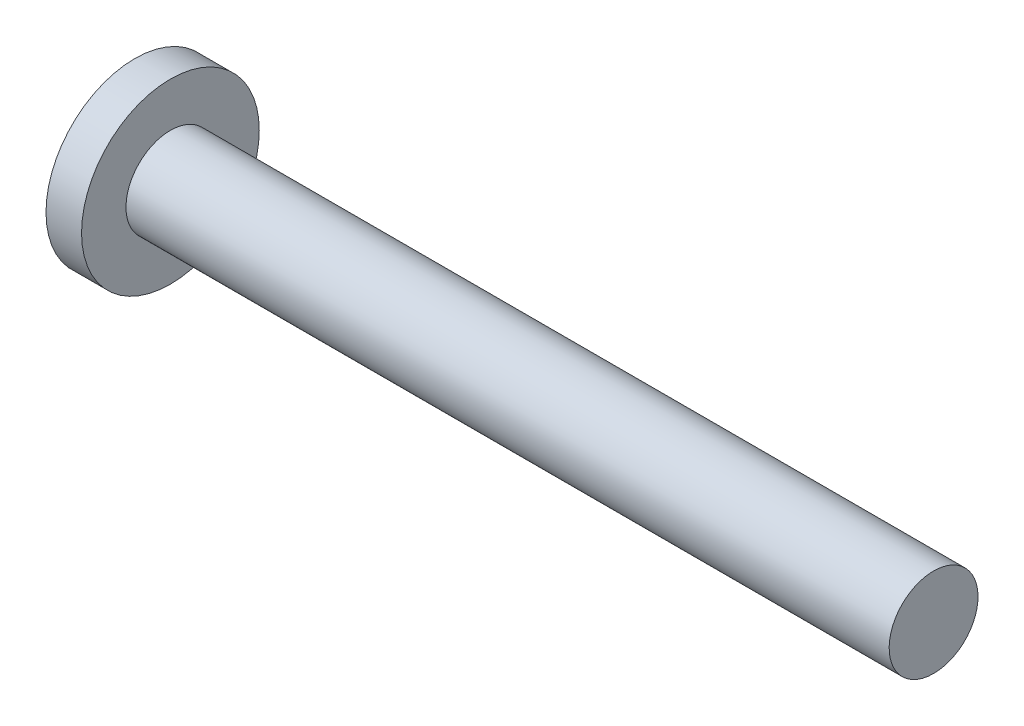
ISO-10303-21;
HEADER;
FILE_DESCRIPTION(('STEP AP214'),'2;1');
FILE_NAME('part.step','',(''),(''),'','','');
FILE_SCHEMA(('AUTOMOTIVE_DESIGN { 1 0 10303 214 1 1 1 1 }'));
ENDSEC;
DATA;
#1=APPLICATION_CONTEXT('core data for automotive mechanical design processes');
#2=APPLICATION_PROTOCOL_DEFINITION('international standard','automotive_design',2000,#1);
#3=PRODUCT_CONTEXT('',#1,'mechanical');
#4=PRODUCT('Part','Part','',(#3));
#5=PRODUCT_RELATED_PRODUCT_CATEGORY('part','',(#4));
#6=PRODUCT_DEFINITION_FORMATION('','',#4);
#7=PRODUCT_DEFINITION_CONTEXT('part definition',#1,'design');
#8=PRODUCT_DEFINITION('design','',#6,#7);
#9=PRODUCT_DEFINITION_SHAPE('','',#8);
#10=(LENGTH_UNIT() NAMED_UNIT(*) SI_UNIT(.MILLI.,.METRE.));
#11=(NAMED_UNIT(*) PLANE_ANGLE_UNIT() SI_UNIT($,.RADIAN.));
#12=(NAMED_UNIT(*) SI_UNIT($,.STERADIAN.) SOLID_ANGLE_UNIT());
#13=UNCERTAINTY_MEASURE_WITH_UNIT(LENGTH_MEASURE(1.E-05),#10,'distance_accuracy_value','');
#14=(GEOMETRIC_REPRESENTATION_CONTEXT(3) GLOBAL_UNCERTAINTY_ASSIGNED_CONTEXT((#13)) GLOBAL_UNIT_ASSIGNED_CONTEXT((#10,
#11,#12)) REPRESENTATION_CONTEXT('',''));
#15=CARTESIAN_POINT('',(0.,0.,0.));
#16=DIRECTION('',(0.,0.,1.));
#17=DIRECTION('',(1.,0.,0.));
#18=AXIS2_PLACEMENT_3D('',#15,#16,#17);
#19=CARTESIAN_POINT('',(30.48,1.69545,0.));
#20=DIRECTION('',(-1.,0.,0.));
#21=DIRECTION('',(0.,-1.,0.));
#22=AXIS2_PLACEMENT_3D('',#19,#20,#21);
#23=PLANE('',#22);
#24=CARTESIAN_POINT('',(30.48,0.,0.));
#25=DIRECTION('',(-1.,0.,0.));
#26=DIRECTION('',(0.,-1.,0.));
#27=AXIS2_PLACEMENT_3D('',#24,#25,#26);
#28=CIRCLE('',#27,1.69545);
#29=CARTESIAN_POINT('',(30.48,-1.69545,0.));
#30=VERTEX_POINT('',#29);
#31=EDGE_CURVE('E10',#30,#30,#28,.T.);
#32=ORIENTED_EDGE('',*,*,#31,.F.);
#33=EDGE_LOOP('',(#32));
#34=FACE_BOUND('',#33,.T.);
#35=ADVANCED_FACE('F31',(#34),#23,.F.);
#36=CARTESIAN_POINT('',(30.48,0.,0.));
#37=DIRECTION('',(-1.,0.,0.));
#38=DIRECTION('',(0.,-1.,0.));
#39=AXIS2_PLACEMENT_3D('',#36,#37,#38);
#40=CYLINDRICAL_SURFACE('',#39,1.69545);
#41=CARTESIAN_POINT('',(1.35636,0.,0.));
#42=DIRECTION('',(-1.,0.,0.));
#43=DIRECTION('',(0.,-1.,0.));
#44=AXIS2_PLACEMENT_3D('',#41,#42,#43);
#45=CIRCLE('',#44,1.69545);
#46=CARTESIAN_POINT('',(1.35636,-1.69545,0.));
#47=VERTEX_POINT('',#46);
#48=EDGE_CURVE('E37',#47,#47,#45,.T.);
#49=ORIENTED_EDGE('',*,*,#48,.F.);
#50=EDGE_LOOP('',(#49));
#51=FACE_BOUND('',#50,.T.);
#52=ORIENTED_EDGE('',*,*,#31,.T.);
#53=EDGE_LOOP('',(#52));
#54=FACE_BOUND('',#53,.T.);
#55=ADVANCED_FACE('F61',(#51,#54),#40,.T.);
#56=CARTESIAN_POINT('',(1.35636,3.3909,0.));
#57=DIRECTION('',(-1.,0.,0.));
#58=DIRECTION('',(0.,-1.,0.));
#59=AXIS2_PLACEMENT_3D('',#56,#57,#58);
#60=PLANE('',#59);
#61=CARTESIAN_POINT('',(1.35636,0.,0.));
#62=DIRECTION('',(-1.,0.,0.));
#63=DIRECTION('',(0.,-1.,0.));
#64=AXIS2_PLACEMENT_3D('',#61,#62,#63);
#65=CIRCLE('',#64,3.3909);
#66=CARTESIAN_POINT('',(1.35636,-3.3909,0.));
#67=VERTEX_POINT('',#66);
#68=EDGE_CURVE('E41',#67,#67,#65,.T.);
#69=ORIENTED_EDGE('',*,*,#68,.F.);
#70=EDGE_LOOP('',(#69));
#71=FACE_BOUND('',#70,.T.);
#72=ORIENTED_EDGE('',*,*,#48,.T.);
#73=EDGE_LOOP('',(#72));
#74=FACE_BOUND('',#73,.T.);
#75=ADVANCED_FACE('F56',(#71,#74),#60,.F.);
#76=CARTESIAN_POINT('',(30.48,0.,0.));
#77=DIRECTION('',(-1.,0.,0.));
#78=DIRECTION('',(0.,-1.,0.));
#79=AXIS2_PLACEMENT_3D('',#76,#77,#78);
#80=CYLINDRICAL_SURFACE('',#79,3.3909);
#81=CARTESIAN_POINT('',(0.,0.,0.));
#82=DIRECTION('',(-1.,0.,0.));
#83=DIRECTION('',(0.,-1.,0.));
#84=AXIS2_PLACEMENT_3D('',#81,#82,#83);
#85=CIRCLE('',#84,3.3909);
#86=CARTESIAN_POINT('',(0.,-3.3909,0.));
#87=VERTEX_POINT('',#86);
#88=EDGE_CURVE('E45',#87,#87,#85,.T.);
#89=ORIENTED_EDGE('',*,*,#88,.F.);
#90=EDGE_LOOP('',(#89));
#91=FACE_BOUND('',#90,.T.);
#92=ORIENTED_EDGE('',*,*,#68,.T.);
#93=EDGE_LOOP('',(#92));
#94=FACE_BOUND('',#93,.T.);
#95=ADVANCED_FACE('F53',(#91,#94),#80,.T.);
#96=CARTESIAN_POINT('',(0.,0.,0.));
#97=DIRECTION('',(1.,0.,0.));
#98=DIRECTION('',(0.,1.,0.));
#99=AXIS2_PLACEMENT_3D('',#96,#97,#98);
#100=PLANE('',#99);
#101=ORIENTED_EDGE('',*,*,#88,.T.);
#102=EDGE_LOOP('',(#101));
#103=FACE_BOUND('',#102,.T.);
#104=ADVANCED_FACE('F51',(#103),#100,.F.);
#105=CLOSED_SHELL('',(#35,#55,#75,#95,#104));
#106=MANIFOLD_SOLID_BREP('B2',#105);
#107=ADVANCED_BREP_SHAPE_REPRESENTATION('',(#18,#106),#14);
#108=SHAPE_DEFINITION_REPRESENTATION(#9,#107);
ENDSEC;
END-ISO-10303-21;
